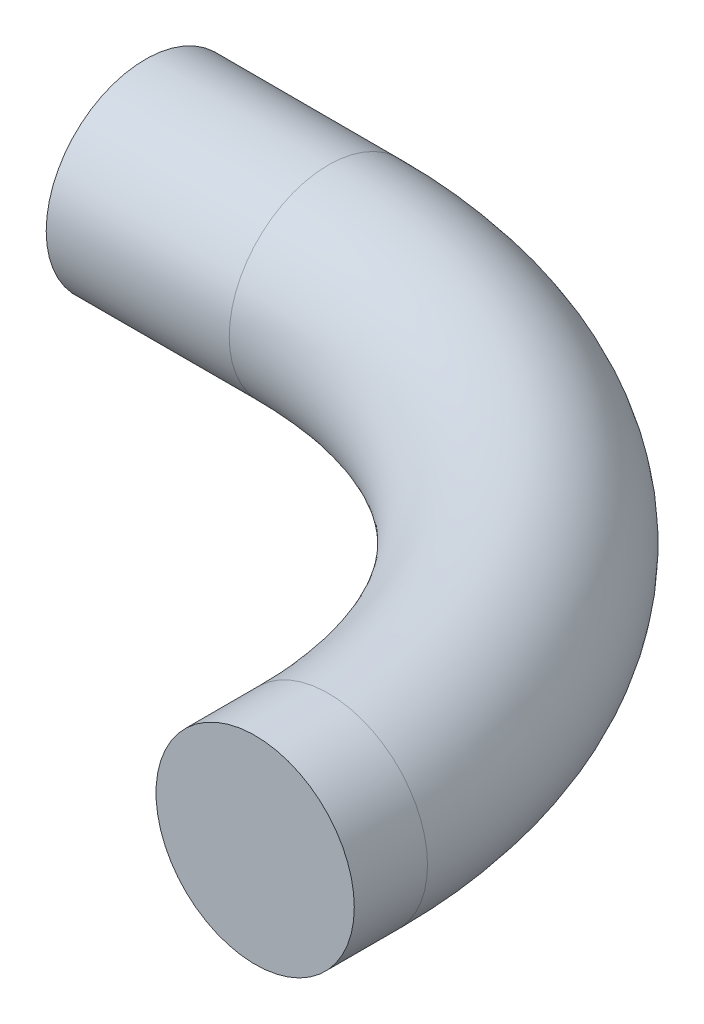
ISO-10303-21;
HEADER;
FILE_DESCRIPTION(('STEP AP214'),'2;1');
FILE_NAME('part.step','',(''),(''),'','','');
FILE_SCHEMA(('AUTOMOTIVE_DESIGN { 1 0 10303 214 1 1 1 1 }'));
ENDSEC;
DATA;
#1=APPLICATION_CONTEXT('core data for automotive mechanical design processes');
#2=APPLICATION_PROTOCOL_DEFINITION('international standard','automotive_design',2000,#1);
#3=PRODUCT_CONTEXT('',#1,'mechanical');
#4=PRODUCT('Part','Part','',(#3));
#5=PRODUCT_RELATED_PRODUCT_CATEGORY('part','',(#4));
#6=PRODUCT_DEFINITION_FORMATION('','',#4);
#7=PRODUCT_DEFINITION_CONTEXT('part definition',#1,'design');
#8=PRODUCT_DEFINITION('design','',#6,#7);
#9=PRODUCT_DEFINITION_SHAPE('','',#8);
#10=(LENGTH_UNIT() NAMED_UNIT(*) SI_UNIT(.MILLI.,.METRE.));
#11=(NAMED_UNIT(*) PLANE_ANGLE_UNIT() SI_UNIT($,.RADIAN.));
#12=(NAMED_UNIT(*) SI_UNIT($,.STERADIAN.) SOLID_ANGLE_UNIT());
#13=UNCERTAINTY_MEASURE_WITH_UNIT(LENGTH_MEASURE(1.E-05),#10,'distance_accuracy_value','');
#14=(GEOMETRIC_REPRESENTATION_CONTEXT(3) GLOBAL_UNCERTAINTY_ASSIGNED_CONTEXT((#13)) GLOBAL_UNIT_ASSIGNED_CONTEXT((#10,
#11,#12)) REPRESENTATION_CONTEXT('',''));
#15=CARTESIAN_POINT('',(0.,0.,0.));
#16=DIRECTION('',(0.,0.,1.));
#17=DIRECTION('',(1.,0.,0.));
#18=AXIS2_PLACEMENT_3D('',#15,#16,#17);
#19=CARTESIAN_POINT('',(-150.,0.,0.));
#20=DIRECTION('',(-1.,0.,0.));
#21=DIRECTION('',(0.,0.,1.));
#22=AXIS2_PLACEMENT_3D('',#19,#20,#21);
#23=CYLINDRICAL_SURFACE('',#22,32.5);
#24=CARTESIAN_POINT('',(-150.,0.,0.));
#25=DIRECTION('',(-1.,0.,0.));
#26=DIRECTION('',(0.,0.,1.));
#27=AXIS2_PLACEMENT_3D('',#24,#25,#26);
#28=CIRCLE('',#27,32.5);
#29=CARTESIAN_POINT('',(-150.,0.,-32.5));
#30=VERTEX_POINT('',#29);
#31=EDGE_CURVE('E23',#30,#30,#28,.T.);
#32=ORIENTED_EDGE('',*,*,#31,.T.);
#33=EDGE_LOOP('',(#32));
#34=FACE_BOUND('',#33,.T.);
#35=CARTESIAN_POINT('',(-210.,0.,0.));
#36=DIRECTION('',(-1.,0.,0.));
#37=DIRECTION('',(0.,0.,1.));
#38=AXIS2_PLACEMENT_3D('',#35,#36,#37);
#39=CIRCLE('',#38,32.5);
#40=CARTESIAN_POINT('',(-210.,0.,32.5));
#41=VERTEX_POINT('',#40);
#42=EDGE_CURVE('E18',#41,#41,#39,.F.);
#43=ORIENTED_EDGE('',*,*,#42,.T.);
#44=EDGE_LOOP('',(#43));
#45=FACE_BOUND('',#44,.T.);
#46=ADVANCED_FACE('F14',(#34,#45),#23,.T.);
#47=CARTESIAN_POINT('',(0.,0.,150.));
#48=DIRECTION('',(0.,0.,1.));
#49=DIRECTION('',(1.,0.,0.));
#50=AXIS2_PLACEMENT_3D('',#47,#48,#49);
#51=CYLINDRICAL_SURFACE('',#50,32.5);
#52=CARTESIAN_POINT('',(0.,0.,150.));
#53=DIRECTION('',(0.,0.,-1.));
#54=DIRECTION('',(-1.,0.,0.));
#55=AXIS2_PLACEMENT_3D('',#52,#53,#54);
#56=CIRCLE('',#55,32.5);
#57=CARTESIAN_POINT('',(32.5,0.,150.));
#58=VERTEX_POINT('',#57);
#59=EDGE_CURVE('E10',#58,#58,#56,.T.);
#60=ORIENTED_EDGE('',*,*,#59,.F.);
#61=EDGE_LOOP('',(#60));
#62=FACE_BOUND('',#61,.T.);
#63=CARTESIAN_POINT('',(0.,0.,174.));
#64=DIRECTION('',(0.,0.,1.));
#65=DIRECTION('',(1.,0.,0.));
#66=AXIS2_PLACEMENT_3D('',#63,#64,#65);
#67=CIRCLE('',#66,32.5);
#68=CARTESIAN_POINT('',(32.5,0.,174.));
#69=VERTEX_POINT('',#68);
#70=EDGE_CURVE('E31',#69,#69,#67,.T.);
#71=ORIENTED_EDGE('',*,*,#70,.F.);
#72=EDGE_LOOP('',(#71));
#73=FACE_BOUND('',#72,.T.);
#74=ADVANCED_FACE('F16',(#62,#73),#51,.T.);
#75=CARTESIAN_POINT('',(-150.,0.,150.));
#76=DIRECTION('',(0.,-1.,0.));
#77=DIRECTION('',(0.,0.,-1.));
#78=AXIS2_PLACEMENT_3D('',#75,#76,#77);
#79=TOROIDAL_SURFACE('',#78,150.,32.5);
#80=CARTESIAN_POINT('',(-150.,0.,150.));
#81=DIRECTION('',(0.,-1.,0.));
#82=DIRECTION('',(0.,0.,-1.));
#83=AXIS2_PLACEMENT_3D('',#80,#81,#82);
#84=CIRCLE('',#83,182.5);
#85=EDGE_CURVE('',#30,#58,#84,.T.);
#86=ORIENTED_EDGE('',*,*,#31,.F.);
#87=ORIENTED_EDGE('',*,*,#59,.T.);
#88=ORIENTED_EDGE('',*,*,#85,.T.);
#89=ORIENTED_EDGE('',*,*,#85,.F.);
#90=EDGE_LOOP('',(#86,#88,#87,#89));
#91=FACE_BOUND('',#90,.T.);
#92=ADVANCED_FACE('F49',(#91),#79,.T.);
#93=CARTESIAN_POINT('',(2.88010500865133E-13,0.,174.));
#94=DIRECTION('',(0.,0.,1.));
#95=DIRECTION('',(1.,0.,0.));
#96=AXIS2_PLACEMENT_3D('',#93,#94,#95);
#97=PLANE('',#96);
#98=ORIENTED_EDGE('',*,*,#70,.T.);
#99=EDGE_LOOP('',(#98));
#100=FACE_BOUND('',#99,.T.);
#101=ADVANCED_FACE('F42',(#100),#97,.T.);
#102=CARTESIAN_POINT('',(-210.,0.,0.));
#103=DIRECTION('',(-1.,0.,0.));
#104=DIRECTION('',(0.,0.,1.));
#105=AXIS2_PLACEMENT_3D('',#102,#103,#104);
#106=PLANE('',#105);
#107=ORIENTED_EDGE('',*,*,#42,.F.);
#108=EDGE_LOOP('',(#107));
#109=FACE_BOUND('',#108,.T.);
#110=ADVANCED_FACE('F40',(#109),#106,.T.);
#111=CLOSED_SHELL('',(#46,#74,#92,#101,#110));
#112=MANIFOLD_SOLID_BREP('B1',#111);
#113=ADVANCED_BREP_SHAPE_REPRESENTATION('',(#18,#112),#14);
#114=SHAPE_DEFINITION_REPRESENTATION(#9,#113);
ENDSEC;
END-ISO-10303-21;
